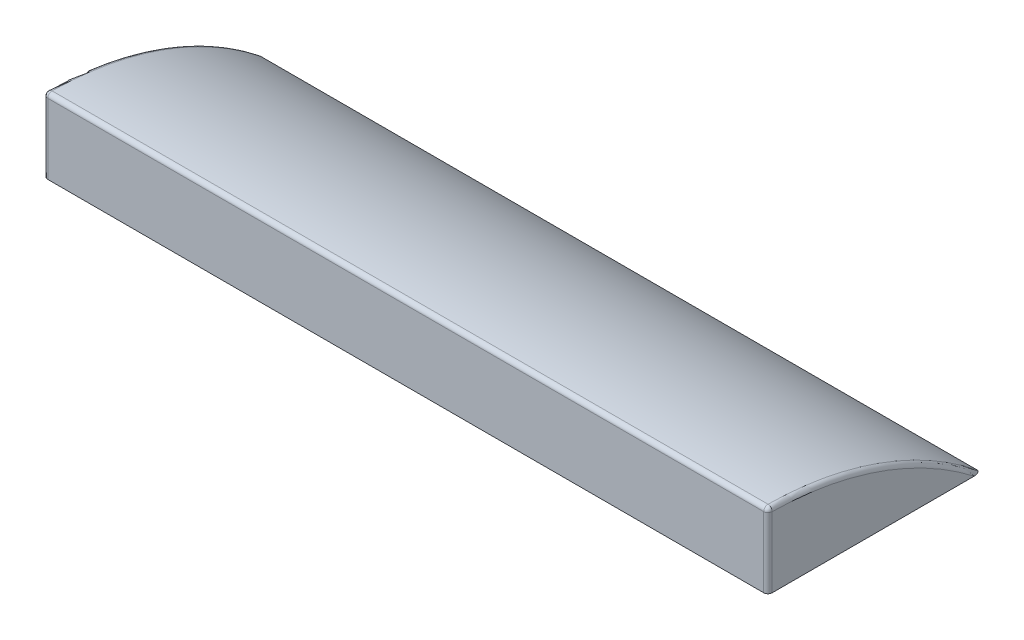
ISO-10303-21;
HEADER;
FILE_DESCRIPTION(('STEP AP214'),'2;1');
FILE_NAME('part.step','',(''),(''),'','','');
FILE_SCHEMA(('AUTOMOTIVE_DESIGN { 1 0 10303 214 1 1 1 1 }'));
ENDSEC;
DATA;
#1=APPLICATION_CONTEXT('core data for automotive mechanical design processes');
#2=APPLICATION_PROTOCOL_DEFINITION('international standard','automotive_design',2000,#1);
#3=PRODUCT_CONTEXT('',#1,'mechanical');
#4=PRODUCT('Part','Part','',(#3));
#5=PRODUCT_RELATED_PRODUCT_CATEGORY('part','',(#4));
#6=PRODUCT_DEFINITION_FORMATION('','',#4);
#7=PRODUCT_DEFINITION_CONTEXT('part definition',#1,'design');
#8=PRODUCT_DEFINITION('design','',#6,#7);
#9=PRODUCT_DEFINITION_SHAPE('','',#8);
#10=(LENGTH_UNIT() NAMED_UNIT(*) SI_UNIT(.MILLI.,.METRE.));
#11=(NAMED_UNIT(*) PLANE_ANGLE_UNIT() SI_UNIT($,.RADIAN.));
#12=(NAMED_UNIT(*) SI_UNIT($,.STERADIAN.) SOLID_ANGLE_UNIT());
#13=UNCERTAINTY_MEASURE_WITH_UNIT(LENGTH_MEASURE(1.E-05),#10,'distance_accuracy_value','');
#14=(GEOMETRIC_REPRESENTATION_CONTEXT(3) GLOBAL_UNCERTAINTY_ASSIGNED_CONTEXT((#13)) GLOBAL_UNIT_ASSIGNED_CONTEXT((#10,
#11,#12)) REPRESENTATION_CONTEXT('',''));
#15=CARTESIAN_POINT('',(0.,0.,0.));
#16=DIRECTION('',(0.,0.,1.));
#17=DIRECTION('',(1.,0.,0.));
#18=AXIS2_PLACEMENT_3D('',#15,#16,#17);
#19=CARTESIAN_POINT('',(850.,0.,0.));
#20=DIRECTION('',(0.,0.,-1.));
#21=DIRECTION('',(-1.,0.,0.));
#22=AXIS2_PLACEMENT_3D('',#19,#20,#21);
#23=PLANE('',#22);
#24=DIRECTION('',(-1.,0.,0.));
#25=VECTOR('',#24,1.);
#26=CARTESIAN_POINT('',(850.,0.,0.));
#27=LINE('',#26,#25);
#28=CARTESIAN_POINT('',(840.,0.,0.));
#29=VERTEX_POINT('',#28);
#30=CARTESIAN_POINT('',(-840.,0.,0.));
#31=VERTEX_POINT('',#30);
#32=EDGE_CURVE('E116',#29,#31,#27,.T.);
#33=ORIENTED_EDGE('',*,*,#32,.F.);
#34=DIRECTION('',(0.,-1.,0.));
#35=VECTOR('',#34,1.);
#36=CARTESIAN_POINT('',(840.,174.999999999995,0.));
#37=LINE('',#36,#35);
#38=CARTESIAN_POINT('',(840.,164.944616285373,0.));
#39=VERTEX_POINT('',#38);
#40=EDGE_CURVE('E11',#29,#39,#37,.F.);
#41=ORIENTED_EDGE('',*,*,#40,.T.);
#42=DIRECTION('',(-1.,0.,0.));
#43=VECTOR('',#42,1.);
#44=CARTESIAN_POINT('',(850.,164.944616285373,0.));
#45=LINE('',#44,#43);
#46=CARTESIAN_POINT('',(-840.,164.944616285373,0.));
#47=VERTEX_POINT('',#46);
#48=EDGE_CURVE('E45',#39,#47,#45,.T.);
#49=ORIENTED_EDGE('',*,*,#48,.T.);
#50=DIRECTION('',(0.,-1.,0.));
#51=VECTOR('',#50,1.);
#52=CARTESIAN_POINT('',(-840.,0.,0.));
#53=LINE('',#52,#51);
#54=EDGE_CURVE('E176',#47,#31,#53,.T.);
#55=ORIENTED_EDGE('',*,*,#54,.T.);
#56=EDGE_LOOP('',(#33,#41,#49,#55));
#57=FACE_BOUND('',#56,.T.);
#58=ADVANCED_FACE('F35',(#57),#23,.F.);
#59=CARTESIAN_POINT('',(850.,0.,0.));
#60=DIRECTION('',(0.,1.,0.));
#61=DIRECTION('',(0.,0.,1.));
#62=AXIS2_PLACEMENT_3D('',#59,#60,#61);
#63=PLANE('',#62);
#64=CARTESIAN_POINT('',(250.,0.,-250.));
#65=DIRECTION('',(0.,-1.,0.));
#66=DIRECTION('',(0.,0.,1.));
#67=AXIS2_PLACEMENT_3D('',#64,#65,#66);
#68=CIRCLE('',#67,5.00000000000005);
#69=CARTESIAN_POINT('',(250.,0.,-245.));
#70=VERTEX_POINT('',#69);
#71=EDGE_CURVE('E210',#70,#70,#68,.T.);
#72=ORIENTED_EDGE('',*,*,#71,.F.);
#73=EDGE_LOOP('',(#72));
#74=FACE_BOUND('',#73,.T.);
#75=CARTESIAN_POINT('',(-250.,0.,-250.));
#76=DIRECTION('',(0.,-1.,0.));
#77=DIRECTION('',(0.,0.,-1.));
#78=AXIS2_PLACEMENT_3D('',#75,#76,#77);
#79=CIRCLE('',#78,4.99999999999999);
#80=CARTESIAN_POINT('',(-250.,0.,-255.));
#81=VERTEX_POINT('',#80);
#82=EDGE_CURVE('E217',#81,#81,#79,.T.);
#83=ORIENTED_EDGE('',*,*,#82,.F.);
#84=EDGE_LOOP('',(#83));
#85=FACE_BOUND('',#84,.T.);
#86=DIRECTION('',(0.,0.,-1.));
#87=VECTOR('',#86,1.);
#88=CARTESIAN_POINT('',(-850.,0.,0.));
#89=LINE('',#88,#87);
#90=CARTESIAN_POINT('',(-850.,1.40500424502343E-13,-10.));
#91=VERTEX_POINT('',#90);
#92=CARTESIAN_POINT('',(-850.,6.79766216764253E-12,-483.817909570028));
#93=VERTEX_POINT('',#92);
#94=EDGE_CURVE('E186',#91,#93,#89,.T.);
#95=ORIENTED_EDGE('',*,*,#94,.T.);
#96=CARTESIAN_POINT('',(-850.,6.79766216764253E-12,-483.817909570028));
#97=CARTESIAN_POINT('',(-849.999982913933,6.80270027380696E-12,-484.176492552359));
#98=CARTESIAN_POINT('',(-849.992783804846,6.80773849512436E-12,-484.535083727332));
#99=CARTESIAN_POINT('',(-849.963837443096,6.81780726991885E-12,-485.251720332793));
#100=CARTESIAN_POINT('',(-849.942088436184,6.82283782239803E-12,-485.609765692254));
#101=CARTESIAN_POINT('',(-849.883772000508,6.83289699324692E-12,-486.325718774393));
#102=CARTESIAN_POINT('',(-849.847160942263,6.83792556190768E-12,-486.683622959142));
#103=CARTESIAN_POINT('',(-849.758811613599,6.84795629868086E-12,-487.397552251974));
#104=CARTESIAN_POINT('',(-849.70707387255,6.85295846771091E-12,-487.753577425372));
#105=CARTESIAN_POINT('',(-849.587320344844,6.86298853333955E-12,-488.467458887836));
#106=CARTESIAN_POINT('',(-849.519109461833,6.8680159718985E-12,-488.825282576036));
#107=CARTESIAN_POINT('',(-849.366222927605,6.87802113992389E-12,-489.537392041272));
#108=CARTESIAN_POINT('',(-849.281547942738,6.88299887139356E-12,-489.891677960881));
#109=CARTESIAN_POINT('',(-849.095177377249,6.89288461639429E-12,-490.595287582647));
#110=CARTESIAN_POINT('',(-848.993503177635,6.89779270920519E-12,-490.944616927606));
#111=CARTESIAN_POINT('',(-848.772275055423,6.90752795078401E-12,-491.637514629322));
#112=CARTESIAN_POINT('',(-848.652724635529,6.9123551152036E-12,-491.981084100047));
#113=CARTESIAN_POINT('',(-848.394968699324,6.92190215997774E-12,-492.66058685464));
#114=CARTESIAN_POINT('',(-848.256791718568,6.92662219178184E-12,-492.996530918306));
#115=CARTESIAN_POINT('',(-847.960536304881,6.93593785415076E-12,-493.659565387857));
#116=CARTESIAN_POINT('',(-847.802458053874,6.9405334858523E-12,-493.986655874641));
#117=CARTESIAN_POINT('',(-847.465565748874,6.94955804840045E-12,-494.628971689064));
#118=CARTESIAN_POINT('',(-847.286805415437,6.95398737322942E-12,-494.944225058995));
#119=CARTESIAN_POINT('',(-846.906875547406,6.96265214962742E-12,-495.560933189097));
#120=CARTESIAN_POINT('',(-846.705710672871,6.96688764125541E-12,-495.862390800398));
#121=CARTESIAN_POINT('',(-846.324862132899,6.97423991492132E-12,-496.385682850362));
#122=CARTESIAN_POINT('',(-846.149717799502,6.9774029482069E-12,-496.610809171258));
#123=CARTESIAN_POINT('',(-845.784035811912,6.98354712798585E-12,-497.048115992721));
#124=CARTESIAN_POINT('',(-845.593497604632,6.98652826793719E-12,-497.260296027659));
#125=CARTESIAN_POINT('',(-844.99814350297,6.99514060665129E-12,-497.873272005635));
#126=CARTESIAN_POINT('',(-844.568920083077,7.00045400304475E-12,-498.251448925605));
#127=CARTESIAN_POINT('',(-843.774235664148,7.00852462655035E-12,-498.825868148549));
#128=CARTESIAN_POINT('',(-843.424314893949,7.01158161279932E-12,-499.043445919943));
#129=CARTESIAN_POINT('',(-842.877153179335,7.01554313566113E-12,-499.325405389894));
#130=CARTESIAN_POINT('',(-842.691214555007,7.01675890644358E-12,-499.411937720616));
#131=CARTESIAN_POINT('',(-842.312645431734,7.01896201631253E-12,-499.568742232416));
#132=CARTESIAN_POINT('',(-842.120018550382,7.01994947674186E-12,-499.639023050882));
#133=CARTESIAN_POINT('',(-841.769626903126,7.02149691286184E-12,-499.749159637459));
#134=CARTESIAN_POINT('',(-841.612888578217,7.02210306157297E-12,-499.792301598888));
#135=CARTESIAN_POINT('',(-841.296655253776,7.02314987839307E-12,-499.866808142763));
#136=CARTESIAN_POINT('',(-841.137160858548,7.02359058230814E-12,-499.898175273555));
#137=CARTESIAN_POINT('',(-840.815279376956,7.02430158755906E-12,-499.948780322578));
#138=CARTESIAN_POINT('',(-840.65288072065,7.02457085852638E-12,-499.967944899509));
#139=CARTESIAN_POINT('',(-840.326993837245,7.02493100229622E-12,-499.993577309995));
#140=CARTESIAN_POINT('',(-840.163505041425,7.0250217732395E-12,-500.000037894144));
#141=CARTESIAN_POINT('',(-840.,7.02502122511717E-12,-500.));
#142=B_SPLINE_CURVE_WITH_KNOTS('',3,(#96,#97,#98,#99,#100,#101,#102,#103,#104,#105,#106,#107,
#108,#109,#110,#111,#112,#113,#114,#115,#116,#117,#118,#119,#120,#121,#122,#123,#124,#125,#126,
#127,#128,#129,#130,#131,#132,#133,#134,#135,#136,#137,#138,#139,#140,#141),.UNSPECIFIED.,.F.,
.F.,(4,2,2,2,2,2,2,2,2,2,2,2,2,2,2,2,2,2,2,2,2,2,4),(0.,1.07568952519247,2.15150876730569,
3.23050932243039,4.30947212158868,5.4019007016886,6.49428507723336,7.58530568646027,
8.67611279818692,9.7652674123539,10.854412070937,11.9407886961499,13.0269397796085,
13.8819407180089,14.7369723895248,16.4435954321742,17.6748604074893,18.2894828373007,
18.9037778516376,19.3910640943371,19.8782448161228,20.3683266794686,20.8586881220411),.UNSPECIFIED.);
#143=CARTESIAN_POINT('',(-840.,7.02502122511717E-12,-500.));
#144=VERTEX_POINT('',#143);
#145=EDGE_CURVE('E115',#93,#144,#142,.T.);
#146=ORIENTED_EDGE('',*,*,#145,.T.);
#147=DIRECTION('',(-1.,0.,0.));
#148=VECTOR('',#147,1.);
#149=CARTESIAN_POINT('',(850.,7.02502122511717E-12,-500.));
#150=LINE('',#149,#148);
#151=CARTESIAN_POINT('',(840.,7.02502122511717E-12,-500.));
#152=VERTEX_POINT('',#151);
#153=EDGE_CURVE('E98',#152,#144,#150,.T.);
#154=ORIENTED_EDGE('',*,*,#153,.F.);
#155=CARTESIAN_POINT('',(840.,7.02502122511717E-12,-500.));
#156=CARTESIAN_POINT('',(840.10469144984,7.02502127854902E-12,-500.000003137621));
#157=CARTESIAN_POINT('',(840.20936467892,7.02498421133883E-12,-499.997365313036));
#158=CARTESIAN_POINT('',(840.418439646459,7.0248363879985E-12,-499.986845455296));
#159=CARTESIAN_POINT('',(840.522841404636,7.02472563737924E-12,-499.978963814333));
#160=CARTESIAN_POINT('',(840.835020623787,7.02428409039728E-12,-499.947538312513));
#161=CARTESIAN_POINT('',(841.042064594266,7.02384399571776E-12,-499.916213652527));
#162=CARTESIAN_POINT('',(841.449849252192,7.02269032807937E-12,-499.83409840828));
#163=CARTESIAN_POINT('',(841.650633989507,7.0219797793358E-12,-499.783523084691));
#164=CARTESIAN_POINT('',(842.046726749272,7.02030216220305E-12,-499.664120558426));
#165=CARTESIAN_POINT('',(842.242033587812,7.019335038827E-12,-499.595289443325));
#166=CARTESIAN_POINT('',(842.625042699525,7.01717040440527E-12,-499.441225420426));
#167=CARTESIAN_POINT('',(842.812774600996,7.01597392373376E-12,-499.356065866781));
#168=CARTESIAN_POINT('',(843.180628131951,7.01337096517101E-12,-499.170801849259));
#169=CARTESIAN_POINT('',(843.360750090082,7.01196449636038E-12,-499.070698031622));
#170=CARTESIAN_POINT('',(843.889842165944,7.00745544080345E-12,-498.749770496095));
#171=CARTESIAN_POINT('',(844.226704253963,7.00406807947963E-12,-498.508677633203));
#172=CARTESIAN_POINT('',(844.788004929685,6.9976064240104E-12,-498.048774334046));
#173=CARTESIAN_POINT('',(845.019879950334,6.99465584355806E-12,-497.838769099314));
#174=CARTESIAN_POINT('',(845.464318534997,6.98847980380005E-12,-497.399194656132));
#175=CARTESIAN_POINT('',(845.676880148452,6.9852543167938E-12,-497.169623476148));
#176=CARTESIAN_POINT('',(846.083600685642,6.9785742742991E-12,-496.694177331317));
#177=CARTESIAN_POINT('',(846.277728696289,6.97511934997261E-12,-496.448276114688));
#178=CARTESIAN_POINT('',(846.648075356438,6.96802623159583E-12,-495.943429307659));
#179=CARTESIAN_POINT('',(846.824294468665,6.96438804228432E-12,-495.684484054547));
#180=CARTESIAN_POINT('',(847.252800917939,6.95490201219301E-12,-495.009323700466));
#181=CARTESIAN_POINT('',(847.493117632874,6.94894707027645E-12,-494.585485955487));
#182=CARTESIAN_POINT('',(847.936217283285,6.93676705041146E-12,-493.718583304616));
#183=CARTESIAN_POINT('',(848.138978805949,6.93054182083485E-12,-493.275507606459));
#184=CARTESIAN_POINT('',(848.51032850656,6.91787302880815E-12,-492.373816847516));
#185=CARTESIAN_POINT('',(848.678814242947,6.91142887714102E-12,-491.915159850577));
#186=CARTESIAN_POINT('',(848.983258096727,6.89839316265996E-12,-490.98735395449));
#187=CARTESIAN_POINT('',(849.119222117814,6.89180162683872E-12,-490.518206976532));
#188=CARTESIAN_POINT('',(849.370216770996,6.87798118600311E-12,-489.534548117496));
#189=CARTESIAN_POINT('',(849.482724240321,6.87074326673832E-12,-489.019394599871));
#190=CARTESIAN_POINT('',(849.674045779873,6.85617935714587E-12,-487.982820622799));
#191=CARTESIAN_POINT('',(849.752852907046,6.84885334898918E-12,-487.461398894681));
#192=CARTESIAN_POINT('',(849.877403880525,6.83422612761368E-12,-486.420318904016));
#193=CARTESIAN_POINT('',(849.923495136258,6.82692549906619E-12,-485.900702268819));
#194=CARTESIAN_POINT('',(849.96946366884,6.81595859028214E-12,-485.12014181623));
#195=CARTESIAN_POINT('',(849.980925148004,6.81230117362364E-12,-484.859828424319));
#196=CARTESIAN_POINT('',(849.996190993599,6.80498329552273E-12,-484.33898482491));
#197=CARTESIAN_POINT('',(849.999995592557,6.80132283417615E-12,-484.078454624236));
#198=CARTESIAN_POINT('',(850.,6.79766216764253E-12,-483.817909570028));
#199=B_SPLINE_CURVE_WITH_KNOTS('',3,(#155,#156,#157,#158,#159,#160,#161,#162,#163,#164,#165,
#166,#167,#168,#169,#170,#171,#172,#173,#174,#175,#176,#177,#178,#179,#180,#181,#182,#183,#184,
#185,#186,#187,#188,#189,#190,#191,#192,#193,#194,#195,#196,#197,#198),.UNSPECIFIED.,.F.,.F.,(4,
2,2,2,2,2,2,2,2,2,2,2,2,2,2,2,2,2,2,2,2,4),(0.,0.314005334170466,0.627987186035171,
1.25507717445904,1.87535178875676,2.49575944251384,3.11344263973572,3.73109913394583,
4.9690933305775,5.90646979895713,6.84394083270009,7.78295721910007,8.7219493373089,
10.1813632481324,11.6416067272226,13.1061523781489,14.570431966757,16.1511091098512,
17.7321117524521,19.2960638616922,20.077664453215,20.8592413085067),.UNSPECIFIED.);
#200=CARTESIAN_POINT('',(850.,6.79766216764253E-12,-483.817909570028));
#201=VERTEX_POINT('',#200);
#202=EDGE_CURVE('E112',#152,#201,#199,.T.);
#203=ORIENTED_EDGE('',*,*,#202,.T.);
#204=DIRECTION('',(0.,0.,-1.));
#205=VECTOR('',#204,1.);
#206=CARTESIAN_POINT('',(850.,0.,0.));
#207=LINE('',#206,#205);
#208=CARTESIAN_POINT('',(850.,1.40500424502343E-13,-10.));
#209=VERTEX_POINT('',#208);
#210=EDGE_CURVE('E117',#209,#201,#207,.T.);
#211=ORIENTED_EDGE('',*,*,#210,.F.);
#212=CARTESIAN_POINT('',(840.,1.11022302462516E-13,-10.));
#213=DIRECTION('',(0.,1.,0.));
#214=DIRECTION('',(0.,0.,1.));
#215=AXIS2_PLACEMENT_3D('',#212,#213,#214);
#216=CIRCLE('',#215,10.);
#217=EDGE_CURVE('E121',#209,#29,#216,.F.);
#218=ORIENTED_EDGE('',*,*,#217,.T.);
#219=ORIENTED_EDGE('',*,*,#32,.T.);
#220=CARTESIAN_POINT('',(-840.,1.40500424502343E-13,-10.));
#221=DIRECTION('',(0.,1.,0.));
#222=DIRECTION('',(0.,0.,1.));
#223=AXIS2_PLACEMENT_3D('',#220,#221,#222);
#224=CIRCLE('',#223,10.);
#225=EDGE_CURVE('E125',#31,#91,#224,.F.);
#226=ORIENTED_EDGE('',*,*,#225,.T.);
#227=EDGE_LOOP('',(#95,#146,#154,#203,#211,#218,#219,#226));
#228=FACE_BOUND('',#227,.T.);
#229=ADVANCED_FACE('F110',(#74,#85,#228),#63,.F.);
#230=CARTESIAN_POINT('',(850.,-624.999755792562,-0.625085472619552));
#231=DIRECTION('',(-1.,0.,0.));
#232=DIRECTION('',(0.,0.,1.));
#233=AXIS2_PLACEMENT_3D('',#230,#231,#232);
#234=CYLINDRICAL_SURFACE('',#233,800.);
#235=ORIENTED_EDGE('',*,*,#153,.T.);
#236=CARTESIAN_POINT('',(-840.,-624.999755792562,-0.625085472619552));
#237=DIRECTION('',(1.,0.,0.));
#238=DIRECTION('',(0.,0.,-1.));
#239=AXIS2_PLACEMENT_3D('',#236,#237,#238);
#240=CIRCLE('',#239,800.);
#241=CARTESIAN_POINT('',(-840.,174.943912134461,-10.1186698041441));
#242=VERTEX_POINT('',#241);
#243=EDGE_CURVE('E106',#144,#242,#240,.T.);
#244=ORIENTED_EDGE('',*,*,#243,.T.);
#245=DIRECTION('',(-1.,0.,0.));
#246=VECTOR('',#245,1.);
#247=CARTESIAN_POINT('',(850.,174.943912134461,-10.1186698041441));
#248=LINE('',#247,#246);
#249=CARTESIAN_POINT('',(840.,174.943912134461,-10.1186698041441));
#250=VERTEX_POINT('',#249);
#251=EDGE_CURVE('E101',#242,#250,#248,.F.);
#252=ORIENTED_EDGE('',*,*,#251,.T.);
#253=CARTESIAN_POINT('',(840.,-624.999755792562,-0.625085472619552));
#254=DIRECTION('',(1.,0.,0.));
#255=DIRECTION('',(0.,0.,-1.));
#256=AXIS2_PLACEMENT_3D('',#253,#254,#255);
#257=CIRCLE('',#256,800.);
#258=EDGE_CURVE('E94',#250,#152,#257,.F.);
#259=ORIENTED_EDGE('',*,*,#258,.T.);
#260=EDGE_LOOP('',(#235,#244,#252,#259));
#261=FACE_BOUND('',#260,.T.);
#262=ADVANCED_FACE('F96',(#261),#234,.T.);
#263=CARTESIAN_POINT('',(850.,-624.999755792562,-0.625085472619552));
#264=DIRECTION('',(1.,0.,0.));
#265=DIRECTION('',(0.,0.,-1.));
#266=AXIS2_PLACEMENT_3D('',#263,#264,#265);
#267=PLANE('',#266);
#268=ORIENTED_EDGE('',*,*,#210,.T.);
#269=CARTESIAN_POINT('',(850.,-624.999755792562,-0.625085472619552));
#270=DIRECTION('',(1.,0.,0.));
#271=DIRECTION('',(0.,0.,-1.));
#272=AXIS2_PLACEMENT_3D('',#269,#270,#271);
#273=CIRCLE('',#272,790.);
#274=CARTESIAN_POINT('',(850.,164.944616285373,-10.));
#275=VERTEX_POINT('',#274);
#276=EDGE_CURVE('E120',#201,#275,#273,.T.);
#277=ORIENTED_EDGE('',*,*,#276,.T.);
#278=DIRECTION('',(0.,-1.,0.));
#279=VECTOR('',#278,1.);
#280=CARTESIAN_POINT('',(850.,0.,-10.));
#281=LINE('',#280,#279);
#282=EDGE_CURVE('E123',#275,#209,#281,.T.);
#283=ORIENTED_EDGE('',*,*,#282,.T.);
#284=EDGE_LOOP('',(#268,#277,#283));
#285=FACE_BOUND('',#284,.T.);
#286=ADVANCED_FACE('F225',(#285),#267,.T.);
#287=CARTESIAN_POINT('',(-850.,-624.999755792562,-0.625085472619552));
#288=DIRECTION('',(1.,0.,0.));
#289=DIRECTION('',(0.,0.,-1.));
#290=AXIS2_PLACEMENT_3D('',#287,#288,#289);
#291=PLANE('',#290);
#292=DIRECTION('',(0.,-1.,0.));
#293=VECTOR('',#292,1.);
#294=CARTESIAN_POINT('',(-850.,-624.999755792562,-10.));
#295=LINE('',#294,#293);
#296=CARTESIAN_POINT('',(-850.,164.944616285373,-10.));
#297=VERTEX_POINT('',#296);
#298=EDGE_CURVE('E182',#91,#297,#295,.F.);
#299=ORIENTED_EDGE('',*,*,#298,.T.);
#300=CARTESIAN_POINT('',(-850.,-624.999755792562,-0.625085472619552));
#301=DIRECTION('',(1.,0.,0.));
#302=DIRECTION('',(0.,0.,-1.));
#303=AXIS2_PLACEMENT_3D('',#300,#301,#302);
#304=CIRCLE('',#303,790.);
#305=EDGE_CURVE('E184',#297,#93,#304,.F.);
#306=ORIENTED_EDGE('',*,*,#305,.T.);
#307=ORIENTED_EDGE('',*,*,#94,.F.);
#308=EDGE_LOOP('',(#299,#306,#307));
#309=FACE_BOUND('',#308,.T.);
#310=ADVANCED_FACE('F189',(#309),#291,.F.);
#311=CARTESIAN_POINT('',(-250.,10.,-250.));
#312=DIRECTION('',(0.,-1.,0.));
#313=DIRECTION('',(0.,0.,-1.));
#314=AXIS2_PLACEMENT_3D('',#311,#312,#313);
#315=CYLINDRICAL_SURFACE('',#314,4.99999999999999);
#316=CARTESIAN_POINT('',(-250.,10.,-250.));
#317=DIRECTION('',(0.,-1.,0.));
#318=DIRECTION('',(0.,0.,-1.));
#319=AXIS2_PLACEMENT_3D('',#316,#317,#318);
#320=CIRCLE('',#319,4.99999999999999);
#321=CARTESIAN_POINT('',(-250.,10.,-255.));
#322=VERTEX_POINT('',#321);
#323=EDGE_CURVE('E192',#322,#322,#320,.T.);
#324=ORIENTED_EDGE('',*,*,#323,.F.);
#325=EDGE_LOOP('',(#324));
#326=FACE_BOUND('',#325,.T.);
#327=ORIENTED_EDGE('',*,*,#82,.T.);
#328=EDGE_LOOP('',(#327));
#329=FACE_BOUND('',#328,.T.);
#330=ADVANCED_FACE('F234',(#326,#329),#315,.F.);
#331=CARTESIAN_POINT('',(-250.,10.,-250.));
#332=DIRECTION('',(0.,-1.,0.));
#333=DIRECTION('',(0.,0.,-1.));
#334=AXIS2_PLACEMENT_3D('',#331,#332,#333);
#335=PLANE('',#334);
#336=ORIENTED_EDGE('',*,*,#323,.T.);
#337=EDGE_LOOP('',(#336));
#338=FACE_BOUND('',#337,.T.);
#339=ADVANCED_FACE('F238',(#338),#335,.T.);
#340=CARTESIAN_POINT('',(250.,10.,-250.));
#341=DIRECTION('',(0.,-1.,0.));
#342=DIRECTION('',(0.,0.,-1.));
#343=AXIS2_PLACEMENT_3D('',#340,#341,#342);
#344=CYLINDRICAL_SURFACE('',#343,5.00000000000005);
#345=CARTESIAN_POINT('',(250.,10.,-250.));
#346=DIRECTION('',(0.,-1.,0.));
#347=DIRECTION('',(0.,0.,1.));
#348=AXIS2_PLACEMENT_3D('',#345,#346,#347);
#349=CIRCLE('',#348,5.00000000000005);
#350=CARTESIAN_POINT('',(250.,10.,-245.));
#351=VERTEX_POINT('',#350);
#352=EDGE_CURVE('E212',#351,#351,#349,.T.);
#353=ORIENTED_EDGE('',*,*,#352,.F.);
#354=EDGE_LOOP('',(#353));
#355=FACE_BOUND('',#354,.T.);
#356=ORIENTED_EDGE('',*,*,#71,.T.);
#357=EDGE_LOOP('',(#356));
#358=FACE_BOUND('',#357,.T.);
#359=ADVANCED_FACE('F242',(#355,#358),#344,.F.);
#360=CARTESIAN_POINT('',(250.,10.,-250.));
#361=DIRECTION('',(0.,1.,0.));
#362=DIRECTION('',(0.,0.,1.));
#363=AXIS2_PLACEMENT_3D('',#360,#361,#362);
#364=PLANE('',#363);
#365=ORIENTED_EDGE('',*,*,#352,.T.);
#366=EDGE_LOOP('',(#365));
#367=FACE_BOUND('',#366,.T.);
#368=ADVANCED_FACE('F171',(#367),#364,.F.);
#369=CARTESIAN_POINT('',(840.,-624.999755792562,-0.625085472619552));
#370=DIRECTION('',(1.,0.,0.));
#371=DIRECTION('',(0.,0.,-1.));
#372=AXIS2_PLACEMENT_3D('',#369,#370,#371);
#373=TOROIDAL_SURFACE('',#372,790.,10.);
#374=ORIENTED_EDGE('',*,*,#202,.F.);
#375=ORIENTED_EDGE('',*,*,#258,.F.);
#376=CARTESIAN_POINT('',(840.,164.944616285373,-10.));
#377=DIRECTION('',(0.,0.0118669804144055,0.999929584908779));
#378=DIRECTION('',(0.,-0.999929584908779,0.0118669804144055));
#379=AXIS2_PLACEMENT_3D('',#376,#377,#378);
#380=CIRCLE('',#379,10.);
#381=EDGE_CURVE('E40',#275,#250,#380,.T.);
#382=ORIENTED_EDGE('',*,*,#381,.F.);
#383=ORIENTED_EDGE('',*,*,#276,.F.);
#384=EDGE_LOOP('',(#374,#375,#382,#383));
#385=FACE_BOUND('',#384,.T.);
#386=ADVANCED_FACE('F37',(#385),#373,.T.);
#387=CARTESIAN_POINT('',(840.,-624.999755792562,-10.));
#388=DIRECTION('',(0.,1.,0.));
#389=DIRECTION('',(0.,0.,1.));
#390=AXIS2_PLACEMENT_3D('',#387,#388,#389);
#391=CYLINDRICAL_SURFACE('',#390,10.);
#392=ORIENTED_EDGE('',*,*,#217,.F.);
#393=ORIENTED_EDGE('',*,*,#282,.F.);
#394=CARTESIAN_POINT('',(840.,164.944616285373,-10.));
#395=DIRECTION('',(0.,1.,0.));
#396=DIRECTION('',(-1.,0.,0.));
#397=AXIS2_PLACEMENT_3D('',#394,#395,#396);
#398=CIRCLE('',#397,10.);
#399=EDGE_CURVE('E207',#39,#275,#398,.T.);
#400=ORIENTED_EDGE('',*,*,#399,.F.);
#401=ORIENTED_EDGE('',*,*,#40,.F.);
#402=EDGE_LOOP('',(#392,#393,#400,#401));
#403=FACE_BOUND('',#402,.T.);
#404=ADVANCED_FACE('F164',(#403),#391,.T.);
#405=CARTESIAN_POINT('',(840.,164.944616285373,-10.));
#406=DIRECTION('',(0.,0.,1.));
#407=DIRECTION('',(1.,0.,0.));
#408=AXIS2_PLACEMENT_3D('',#405,#406,#407);
#409=SPHERICAL_SURFACE('',#408,10.);
#410=ORIENTED_EDGE('',*,*,#399,.T.);
#411=ORIENTED_EDGE('',*,*,#381,.T.);
#412=CARTESIAN_POINT('',(840.,164.944616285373,-10.));
#413=DIRECTION('',(1.,0.,0.));
#414=DIRECTION('',(0.,0.,-1.));
#415=AXIS2_PLACEMENT_3D('',#412,#413,#414);
#416=CIRCLE('',#415,10.);
#417=EDGE_CURVE('E205',#39,#250,#416,.F.);
#418=ORIENTED_EDGE('',*,*,#417,.F.);
#419=EDGE_LOOP('',(#410,#411,#418));
#420=FACE_BOUND('',#419,.T.);
#421=ADVANCED_FACE('F161',(#420),#409,.T.);
#422=CARTESIAN_POINT('',(850.,164.944616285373,-10.));
#423=DIRECTION('',(-1.,0.,0.));
#424=DIRECTION('',(0.,0.,1.));
#425=AXIS2_PLACEMENT_3D('',#422,#423,#424);
#426=CYLINDRICAL_SURFACE('',#425,10.);
#427=ORIENTED_EDGE('',*,*,#417,.T.);
#428=ORIENTED_EDGE('',*,*,#251,.F.);
#429=CARTESIAN_POINT('',(-840.,164.944616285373,-10.));
#430=DIRECTION('',(-1.,0.,0.));
#431=DIRECTION('',(0.,0.,1.));
#432=AXIS2_PLACEMENT_3D('',#429,#430,#431);
#433=CIRCLE('',#432,10.);
#434=EDGE_CURVE('E198',#47,#242,#433,.T.);
#435=ORIENTED_EDGE('',*,*,#434,.F.);
#436=ORIENTED_EDGE('',*,*,#48,.F.);
#437=EDGE_LOOP('',(#427,#428,#435,#436));
#438=FACE_BOUND('',#437,.T.);
#439=ADVANCED_FACE('F157',(#438),#426,.T.);
#440=CARTESIAN_POINT('',(-840.,0.,-10.));
#441=DIRECTION('',(0.,-1.,0.));
#442=DIRECTION('',(0.,0.,-1.));
#443=AXIS2_PLACEMENT_3D('',#440,#441,#442);
#444=CYLINDRICAL_SURFACE('',#443,10.);
#445=ORIENTED_EDGE('',*,*,#225,.F.);
#446=ORIENTED_EDGE('',*,*,#54,.F.);
#447=CARTESIAN_POINT('',(-840.,164.944616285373,-10.));
#448=DIRECTION('',(0.,1.,0.));
#449=DIRECTION('',(0.,0.,1.));
#450=AXIS2_PLACEMENT_3D('',#447,#448,#449);
#451=CIRCLE('',#450,10.);
#452=EDGE_CURVE('E194',#297,#47,#451,.T.);
#453=ORIENTED_EDGE('',*,*,#452,.F.);
#454=ORIENTED_EDGE('',*,*,#298,.F.);
#455=EDGE_LOOP('',(#445,#446,#453,#454));
#456=FACE_BOUND('',#455,.T.);
#457=ADVANCED_FACE('F153',(#456),#444,.T.);
#458=CARTESIAN_POINT('',(-840.,164.944616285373,-10.));
#459=DIRECTION('',(0.,0.,1.));
#460=DIRECTION('',(1.,0.,0.));
#461=AXIS2_PLACEMENT_3D('',#458,#459,#460);
#462=SPHERICAL_SURFACE('',#461,10.);
#463=ORIENTED_EDGE('',*,*,#452,.T.);
#464=ORIENTED_EDGE('',*,*,#434,.T.);
#465=CARTESIAN_POINT('',(-840.,164.944616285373,-10.));
#466=DIRECTION('',(0.,0.0118669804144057,0.99992958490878));
#467=DIRECTION('',(0.,-0.999929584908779,0.0118669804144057));
#468=AXIS2_PLACEMENT_3D('',#465,#466,#467);
#469=CIRCLE('',#468,10.);
#470=EDGE_CURVE('E199',#297,#242,#469,.F.);
#471=ORIENTED_EDGE('',*,*,#470,.F.);
#472=EDGE_LOOP('',(#463,#464,#471));
#473=FACE_BOUND('',#472,.T.);
#474=ADVANCED_FACE('F149',(#473),#462,.T.);
#475=CARTESIAN_POINT('',(-840.,-624.999755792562,-0.625085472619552));
#476=DIRECTION('',(1.,0.,0.));
#477=DIRECTION('',(0.,0.,-1.));
#478=AXIS2_PLACEMENT_3D('',#475,#476,#477);
#479=TOROIDAL_SURFACE('',#478,790.,10.);
#480=ORIENTED_EDGE('',*,*,#145,.F.);
#481=ORIENTED_EDGE('',*,*,#305,.F.);
#482=ORIENTED_EDGE('',*,*,#470,.T.);
#483=ORIENTED_EDGE('',*,*,#243,.F.);
#484=EDGE_LOOP('',(#480,#481,#482,#483));
#485=FACE_BOUND('',#484,.T.);
#486=ADVANCED_FACE('F145',(#485),#479,.T.);
#487=CLOSED_SHELL('',(#58,#229,#262,#286,#310,#330,#339,#359,#368,#386,#404,#421,#439,#457,#474,#486));
#488=MANIFOLD_SOLID_BREP('B2',#487);
#489=ADVANCED_BREP_SHAPE_REPRESENTATION('',(#18,#488),#14);
#490=SHAPE_DEFINITION_REPRESENTATION(#9,#489);
ENDSEC;
END-ISO-10303-21;
